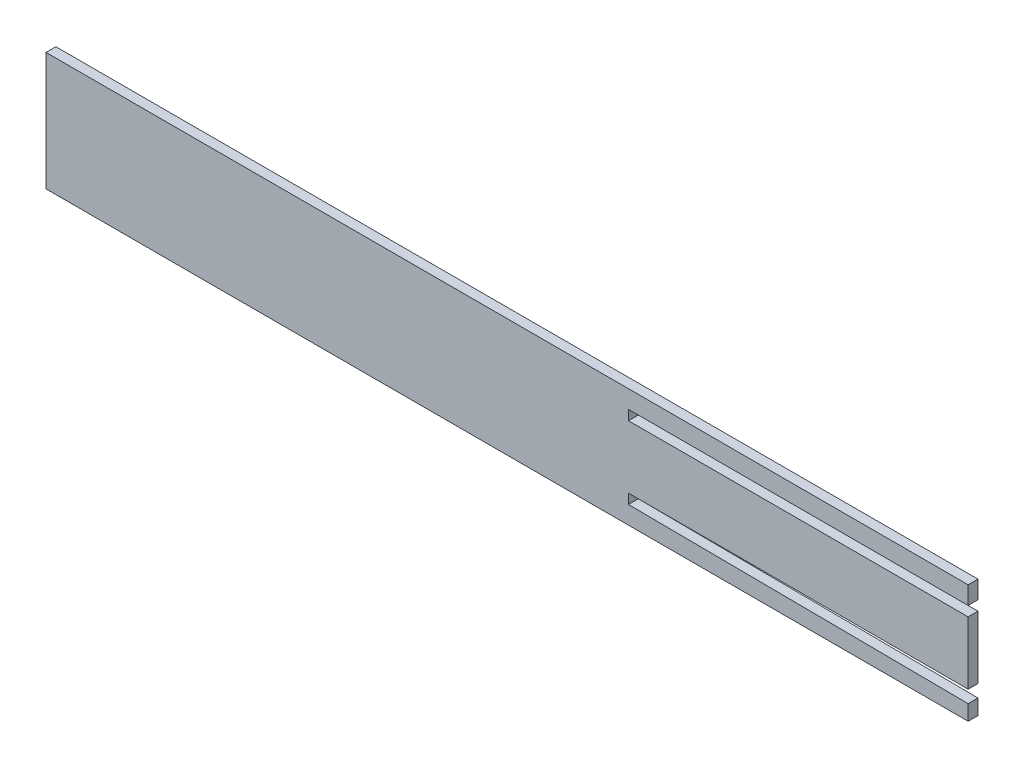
from build123d import *

# Parameters (mm, degrees)
BOSS_EXTRUDE1_DEPTH = 5.5


with BuildPart() as part:
    # Sketch1 → Boss-Extrude1 (new body)
    with BuildSketch(Plane.XY):
        Polygon((0, 0), (514.83, 0), (514.83, 8.520082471), (325.19, 10), (325.19, 15.5), (514.83, 15.5), (514.83, 33), (514.83, 50.5), (325.19, 50.5), (325.19, 56), (514.83, 56), (514.83, 66), (0, 66), align=None)
    extrude(amount=BOSS_EXTRUDE1_DEPTH)


solid = part.part
